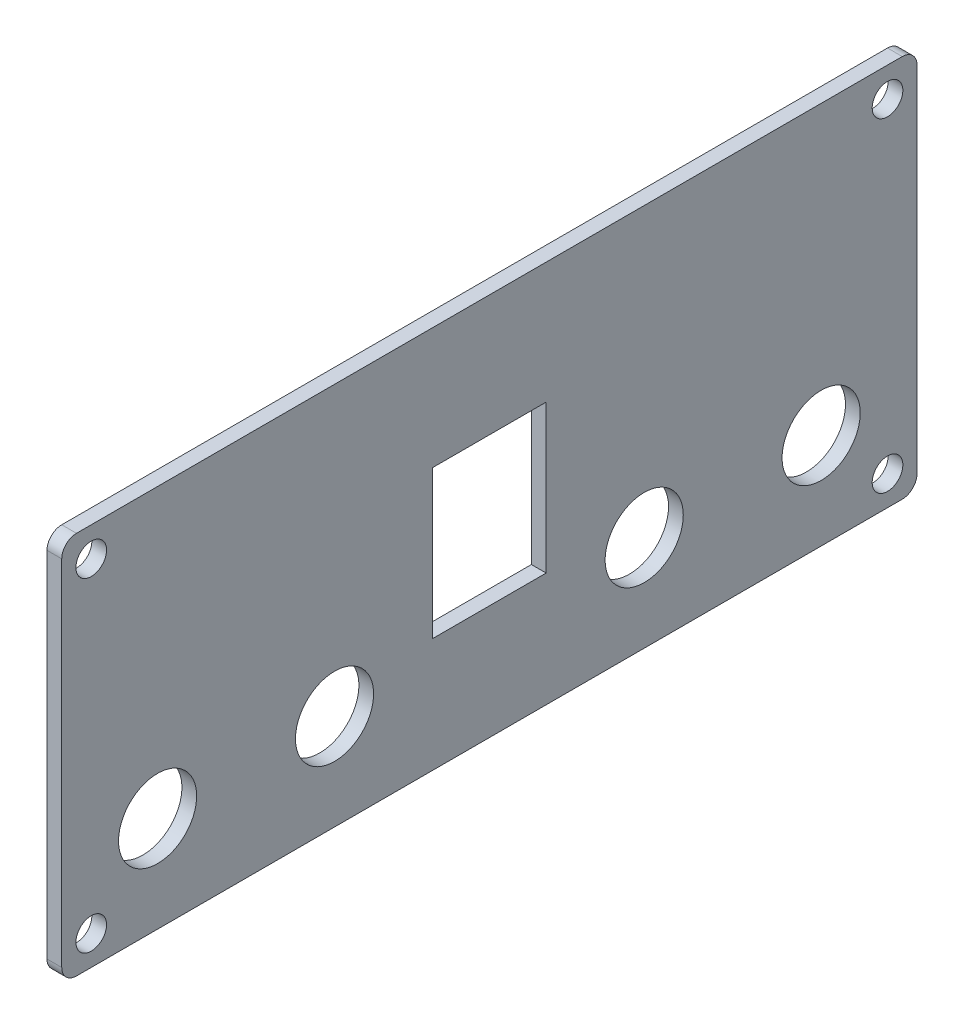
ISO-10303-21;
HEADER;
FILE_DESCRIPTION(('STEP AP214'),'2;1');
FILE_NAME('part.step','',(''),(''),'','','');
FILE_SCHEMA(('AUTOMOTIVE_DESIGN { 1 0 10303 214 1 1 1 1 }'));
ENDSEC;
DATA;
#1=APPLICATION_CONTEXT('core data for automotive mechanical design processes');
#2=APPLICATION_PROTOCOL_DEFINITION('international standard','automotive_design',2000,#1);
#3=PRODUCT_CONTEXT('',#1,'mechanical');
#4=PRODUCT('Part','Part','',(#3));
#5=PRODUCT_RELATED_PRODUCT_CATEGORY('part','',(#4));
#6=PRODUCT_DEFINITION_FORMATION('','',#4);
#7=PRODUCT_DEFINITION_CONTEXT('part definition',#1,'design');
#8=PRODUCT_DEFINITION('design','',#6,#7);
#9=PRODUCT_DEFINITION_SHAPE('','',#8);
#10=(LENGTH_UNIT() NAMED_UNIT(*) SI_UNIT(.MILLI.,.METRE.));
#11=(NAMED_UNIT(*) PLANE_ANGLE_UNIT() SI_UNIT($,.RADIAN.));
#12=(NAMED_UNIT(*) SI_UNIT($,.STERADIAN.) SOLID_ANGLE_UNIT());
#13=UNCERTAINTY_MEASURE_WITH_UNIT(LENGTH_MEASURE(1.E-05),#10,'distance_accuracy_value','');
#14=(GEOMETRIC_REPRESENTATION_CONTEXT(3) GLOBAL_UNCERTAINTY_ASSIGNED_CONTEXT((#13)) GLOBAL_UNIT_ASSIGNED_CONTEXT((#10,
#11,#12)) REPRESENTATION_CONTEXT('',''));
#15=CARTESIAN_POINT('',(0.,0.,0.));
#16=DIRECTION('',(0.,0.,1.));
#17=DIRECTION('',(1.,0.,0.));
#18=AXIS2_PLACEMENT_3D('',#15,#16,#17);
#19=CARTESIAN_POINT('',(-33.450675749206,0.,0.));
#20=DIRECTION('',(1.,0.,0.));
#21=DIRECTION('',(0.,0.,-1.));
#22=AXIS2_PLACEMENT_3D('',#19,#20,#21);
#23=PLANE('',#22);
#24=CARTESIAN_POINT('',(-33.450675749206,-65.961219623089,-62.954833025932));
#25=DIRECTION('',(1.,0.,0.));
#26=DIRECTION('',(0.,0.,-1.));
#27=AXIS2_PLACEMENT_3D('',#24,#25,#26);
#28=CIRCLE('',#27,3.36549999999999);
#29=CARTESIAN_POINT('',(-33.450675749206,-65.961219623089,-66.320333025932));
#30=VERTEX_POINT('',#29);
#31=EDGE_CURVE('E191',#30,#30,#28,.T.);
#32=ORIENTED_EDGE('',*,*,#31,.T.);
#33=EDGE_LOOP('',(#32));
#34=FACE_BOUND('',#33,.T.);
#35=CARTESIAN_POINT('',(-33.450675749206,-65.961219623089,-47.714833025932));
#36=DIRECTION('',(1.,0.,0.));
#37=DIRECTION('',(0.,0.,-1.));
#38=AXIS2_PLACEMENT_3D('',#35,#36,#37);
#39=CIRCLE('',#38,3.3655);
#40=CARTESIAN_POINT('',(-33.450675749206,-65.961219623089,-51.080333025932));
#41=VERTEX_POINT('',#40);
#42=EDGE_CURVE('E563',#41,#41,#39,.T.);
#43=ORIENTED_EDGE('',*,*,#42,.T.);
#44=EDGE_LOOP('',(#43));
#45=FACE_BOUND('',#44,.T.);
#46=DIRECTION('',(0.,0.,-1.));
#47=VECTOR('',#46,1.);
#48=CARTESIAN_POINT('',(-33.450675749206,-64.386419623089,-29.4903330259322));
#49=LINE('',#48,#47);
#50=CARTESIAN_POINT('',(-33.450675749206,-64.386419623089,-29.4903330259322));
#51=VERTEX_POINT('',#50);
#52=CARTESIAN_POINT('',(-33.450675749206,-64.386419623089,-39.2693330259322));
#53=VERTEX_POINT('',#52);
#54=EDGE_CURVE('E140',#51,#53,#49,.T.);
#55=ORIENTED_EDGE('',*,*,#54,.T.);
#56=DIRECTION('',(0.,1.,0.));
#57=VECTOR('',#56,1.);
#58=CARTESIAN_POINT('',(-33.450675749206,-51.635619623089,-39.2693330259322));
#59=LINE('',#58,#57);
#60=CARTESIAN_POINT('',(-33.450675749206,-51.635619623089,-39.2693330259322));
#61=VERTEX_POINT('',#60);
#62=EDGE_CURVE('E133',#53,#61,#59,.T.);
#63=ORIENTED_EDGE('',*,*,#62,.T.);
#64=DIRECTION('',(0.,0.,1.));
#65=VECTOR('',#64,1.);
#66=CARTESIAN_POINT('',(-33.450675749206,-51.635619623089,-29.4903330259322));
#67=LINE('',#66,#65);
#68=CARTESIAN_POINT('',(-33.450675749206,-51.635619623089,-29.4903330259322));
#69=VERTEX_POINT('',#68);
#70=EDGE_CURVE('E143',#61,#69,#67,.T.);
#71=ORIENTED_EDGE('',*,*,#70,.T.);
#72=DIRECTION('',(0.,-1.,0.));
#73=VECTOR('',#72,1.);
#74=CARTESIAN_POINT('',(-33.450675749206,-51.635619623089,-29.4903330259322));
#75=LINE('',#74,#73);
#76=EDGE_CURVE('E57',#69,#51,#75,.T.);
#77=ORIENTED_EDGE('',*,*,#76,.T.);
#78=EDGE_LOOP('',(#55,#63,#71,#77));
#79=FACE_BOUND('',#78,.T.);
#80=CARTESIAN_POINT('',(-33.450675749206,-71.676219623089,-0.0898330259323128));
#81=DIRECTION('',(1.,0.,0.));
#82=DIRECTION('',(0.,0.,1.));
#83=AXIS2_PLACEMENT_3D('',#80,#81,#82);
#84=CIRCLE('',#83,1.32079999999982);
#85=CARTESIAN_POINT('',(-33.450675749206,-71.676219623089,1.2309669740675));
#86=VERTEX_POINT('',#85);
#87=EDGE_CURVE('E182',#86,#86,#84,.T.);
#88=ORIENTED_EDGE('',*,*,#87,.T.);
#89=EDGE_LOOP('',(#88));
#90=FACE_BOUND('',#89,.T.);
#91=CARTESIAN_POINT('',(-33.450675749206,-43.736219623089,-0.0898330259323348));
#92=DIRECTION('',(1.,0.,0.));
#93=DIRECTION('',(0.,0.,1.));
#94=AXIS2_PLACEMENT_3D('',#91,#92,#93);
#95=CIRCLE('',#94,1.3207999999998);
#96=CARTESIAN_POINT('',(-33.450675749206,-43.736219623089,1.23096697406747));
#97=VERTEX_POINT('',#96);
#98=EDGE_CURVE('E192',#97,#97,#95,.T.);
#99=ORIENTED_EDGE('',*,*,#98,.T.);
#100=EDGE_LOOP('',(#99));
#101=FACE_BOUND('',#100,.T.);
#102=CARTESIAN_POINT('',(-33.450675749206,-43.736219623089,-68.669833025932));
#103=DIRECTION('',(1.,0.,0.));
#104=DIRECTION('',(0.,0.,1.));
#105=AXIS2_PLACEMENT_3D('',#102,#103,#104);
#106=CIRCLE('',#105,1.32079999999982);
#107=CARTESIAN_POINT('',(-33.450675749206,-43.736219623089,-67.3490330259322));
#108=VERTEX_POINT('',#107);
#109=EDGE_CURVE('E200',#108,#108,#106,.T.);
#110=ORIENTED_EDGE('',*,*,#109,.T.);
#111=EDGE_LOOP('',(#110));
#112=FACE_BOUND('',#111,.T.);
#113=CARTESIAN_POINT('',(-33.450675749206,-71.676219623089,-68.669833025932));
#114=DIRECTION('',(1.,0.,0.));
#115=DIRECTION('',(0.,0.,1.));
#116=AXIS2_PLACEMENT_3D('',#113,#114,#115);
#117=CIRCLE('',#116,1.32079999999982);
#118=CARTESIAN_POINT('',(-33.450675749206,-71.676219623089,-67.3490330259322));
#119=VERTEX_POINT('',#118);
#120=EDGE_CURVE('E208',#119,#119,#117,.T.);
#121=ORIENTED_EDGE('',*,*,#120,.T.);
#122=EDGE_LOOP('',(#121));
#123=FACE_BOUND('',#122,.T.);
#124=DIRECTION('',(0.,0.,-1.));
#125=VECTOR('',#124,1.);
#126=CARTESIAN_POINT('',(-33.450675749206,-74.216219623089,2.45016697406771));
#127=LINE('',#126,#125);
#128=CARTESIAN_POINT('',(-33.450675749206,-74.216219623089,1.18016697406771));
#129=VERTEX_POINT('',#128);
#130=CARTESIAN_POINT('',(-33.450675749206,-74.216219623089,-69.939833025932));
#131=VERTEX_POINT('',#130);
#132=EDGE_CURVE('E229',#129,#131,#127,.T.);
#133=ORIENTED_EDGE('',*,*,#132,.F.);
#134=CARTESIAN_POINT('',(-33.450675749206,-72.946219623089,1.18016697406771));
#135=DIRECTION('',(1.,0.,0.));
#136=DIRECTION('',(0.,0.,-1.));
#137=AXIS2_PLACEMENT_3D('',#134,#135,#136);
#138=CIRCLE('',#137,1.27);
#139=CARTESIAN_POINT('',(-33.450675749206,-72.946219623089,2.45016697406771));
#140=VERTEX_POINT('',#139);
#141=EDGE_CURVE('E282',#129,#140,#138,.F.);
#142=ORIENTED_EDGE('',*,*,#141,.T.);
#143=DIRECTION('',(0.,-1.,0.));
#144=VECTOR('',#143,1.);
#145=CARTESIAN_POINT('',(-33.450675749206,-41.196219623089,2.45016697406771));
#146=LINE('',#145,#144);
#147=CARTESIAN_POINT('',(-33.450675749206,-42.466219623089,2.45016697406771));
#148=VERTEX_POINT('',#147);
#149=EDGE_CURVE('E225',#148,#140,#146,.T.);
#150=ORIENTED_EDGE('',*,*,#149,.F.);
#151=CARTESIAN_POINT('',(-33.450675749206,-42.466219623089,1.18016697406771));
#152=DIRECTION('',(1.,0.,0.));
#153=DIRECTION('',(0.,0.,-1.));
#154=AXIS2_PLACEMENT_3D('',#151,#152,#153);
#155=CIRCLE('',#154,1.27);
#156=CARTESIAN_POINT('',(-33.450675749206,-41.196219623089,1.18016697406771));
#157=VERTEX_POINT('',#156);
#158=EDGE_CURVE('E276',#148,#157,#155,.F.);
#159=ORIENTED_EDGE('',*,*,#158,.T.);
#160=DIRECTION('',(0.,0.,1.));
#161=VECTOR('',#160,1.);
#162=CARTESIAN_POINT('',(-33.450675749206,-41.196219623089,-71.209833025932));
#163=LINE('',#162,#161);
#164=CARTESIAN_POINT('',(-33.450675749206,-41.196219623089,-69.939833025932));
#165=VERTEX_POINT('',#164);
#166=EDGE_CURVE('E220',#165,#157,#163,.T.);
#167=ORIENTED_EDGE('',*,*,#166,.F.);
#168=CARTESIAN_POINT('',(-33.450675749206,-42.466219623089,-69.939833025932));
#169=DIRECTION('',(1.,0.,0.));
#170=DIRECTION('',(0.,0.,-1.));
#171=AXIS2_PLACEMENT_3D('',#168,#169,#170);
#172=CIRCLE('',#171,1.27);
#173=CARTESIAN_POINT('',(-33.450675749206,-42.466219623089,-71.209833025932));
#174=VERTEX_POINT('',#173);
#175=EDGE_CURVE('E273',#165,#174,#172,.F.);
#176=ORIENTED_EDGE('',*,*,#175,.T.);
#177=DIRECTION('',(0.,1.,0.));
#178=VECTOR('',#177,1.);
#179=CARTESIAN_POINT('',(-33.450675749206,-74.216219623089,-71.209833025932));
#180=LINE('',#179,#178);
#181=CARTESIAN_POINT('',(-33.450675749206,-72.946219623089,-71.209833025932));
#182=VERTEX_POINT('',#181);
#183=EDGE_CURVE('E216',#182,#174,#180,.T.);
#184=ORIENTED_EDGE('',*,*,#183,.F.);
#185=CARTESIAN_POINT('',(-33.450675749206,-72.946219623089,-69.939833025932));
#186=DIRECTION('',(1.,0.,0.));
#187=DIRECTION('',(0.,0.,-1.));
#188=AXIS2_PLACEMENT_3D('',#185,#186,#187);
#189=CIRCLE('',#188,1.27);
#190=EDGE_CURVE('E279',#182,#131,#189,.F.);
#191=ORIENTED_EDGE('',*,*,#190,.T.);
#192=EDGE_LOOP('',(#133,#142,#150,#159,#167,#176,#184,#191));
#193=FACE_BOUND('',#192,.T.);
#194=CARTESIAN_POINT('',(-33.450675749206,-65.961219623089,-21.0448330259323));
#195=DIRECTION('',(-1.,0.,0.));
#196=DIRECTION('',(0.,0.,1.));
#197=AXIS2_PLACEMENT_3D('',#194,#195,#196);
#198=CIRCLE('',#197,3.3655);
#199=CARTESIAN_POINT('',(-33.450675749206,-65.961219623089,-17.6793330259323));
#200=VERTEX_POINT('',#199);
#201=EDGE_CURVE('E546',#200,#200,#198,.T.);
#202=ORIENTED_EDGE('',*,*,#201,.F.);
#203=EDGE_LOOP('',(#202));
#204=FACE_BOUND('',#203,.T.);
#205=CARTESIAN_POINT('',(-33.450675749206,-65.961219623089,-5.80483302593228));
#206=DIRECTION('',(-1.,0.,0.));
#207=DIRECTION('',(0.,0.,1.));
#208=AXIS2_PLACEMENT_3D('',#205,#206,#207);
#209=CIRCLE('',#208,3.36549999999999);
#210=CARTESIAN_POINT('',(-33.450675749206,-65.961219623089,-2.43933302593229));
#211=VERTEX_POINT('',#210);
#212=EDGE_CURVE('E168',#211,#211,#209,.T.);
#213=ORIENTED_EDGE('',*,*,#212,.F.);
#214=EDGE_LOOP('',(#213));
#215=FACE_BOUND('',#214,.T.);
#216=ADVANCED_FACE('F41',(#34,#45,#79,#90,#101,#112,#123,#193,#204,#215),#23,.F.);
#217=CARTESIAN_POINT('',(-32.180675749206,0.,0.));
#218=DIRECTION('',(1.,0.,0.));
#219=DIRECTION('',(0.,0.,-1.));
#220=AXIS2_PLACEMENT_3D('',#217,#218,#219);
#221=PLANE('',#220);
#222=CARTESIAN_POINT('',(-32.180675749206,-65.961219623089,-21.0448330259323));
#223=DIRECTION('',(-1.,0.,0.));
#224=DIRECTION('',(0.,0.,1.));
#225=AXIS2_PLACEMENT_3D('',#222,#223,#224);
#226=CIRCLE('',#225,3.3655);
#227=CARTESIAN_POINT('',(-32.180675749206,-65.961219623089,-17.6793330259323));
#228=VERTEX_POINT('',#227);
#229=EDGE_CURVE('E552',#228,#228,#226,.T.);
#230=ORIENTED_EDGE('',*,*,#229,.T.);
#231=EDGE_LOOP('',(#230));
#232=FACE_BOUND('',#231,.T.);
#233=CARTESIAN_POINT('',(-32.180675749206,-65.961219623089,-62.954833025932));
#234=DIRECTION('',(1.,0.,0.));
#235=DIRECTION('',(0.,0.,-1.));
#236=AXIS2_PLACEMENT_3D('',#233,#234,#235);
#237=CIRCLE('',#236,3.36549999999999);
#238=CARTESIAN_POINT('',(-32.180675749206,-65.961219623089,-66.320333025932));
#239=VERTEX_POINT('',#238);
#240=EDGE_CURVE('E560',#239,#239,#237,.T.);
#241=ORIENTED_EDGE('',*,*,#240,.F.);
#242=EDGE_LOOP('',(#241));
#243=FACE_BOUND('',#242,.T.);
#244=CARTESIAN_POINT('',(-32.180675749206,-65.961219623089,-47.714833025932));
#245=DIRECTION('',(1.,0.,0.));
#246=DIRECTION('',(0.,0.,-1.));
#247=AXIS2_PLACEMENT_3D('',#244,#245,#246);
#248=CIRCLE('',#247,3.3655);
#249=CARTESIAN_POINT('',(-32.180675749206,-65.961219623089,-51.080333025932));
#250=VERTEX_POINT('',#249);
#251=EDGE_CURVE('E158',#250,#250,#248,.T.);
#252=ORIENTED_EDGE('',*,*,#251,.F.);
#253=EDGE_LOOP('',(#252));
#254=FACE_BOUND('',#253,.T.);
#255=DIRECTION('',(0.,1.,0.));
#256=VECTOR('',#255,1.);
#257=CARTESIAN_POINT('',(-32.180675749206,-51.635619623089,-39.2693330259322));
#258=LINE('',#257,#256);
#259=CARTESIAN_POINT('',(-32.180675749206,-64.386419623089,-39.2693330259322));
#260=VERTEX_POINT('',#259);
#261=CARTESIAN_POINT('',(-32.180675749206,-51.635619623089,-39.2693330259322));
#262=VERTEX_POINT('',#261);
#263=EDGE_CURVE('E65',#260,#262,#258,.T.);
#264=ORIENTED_EDGE('',*,*,#263,.F.);
#265=DIRECTION('',(0.,0.,-1.));
#266=VECTOR('',#265,1.);
#267=CARTESIAN_POINT('',(-32.180675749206,-64.386419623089,-29.4903330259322));
#268=LINE('',#267,#266);
#269=CARTESIAN_POINT('',(-32.180675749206,-64.386419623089,-29.4903330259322));
#270=VERTEX_POINT('',#269);
#271=EDGE_CURVE('E151',#270,#260,#268,.T.);
#272=ORIENTED_EDGE('',*,*,#271,.F.);
#273=DIRECTION('',(0.,-1.,0.));
#274=VECTOR('',#273,1.);
#275=CARTESIAN_POINT('',(-32.180675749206,-51.635619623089,-29.4903330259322));
#276=LINE('',#275,#274);
#277=CARTESIAN_POINT('',(-32.180675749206,-51.635619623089,-29.4903330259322));
#278=VERTEX_POINT('',#277);
#279=EDGE_CURVE('E155',#278,#270,#276,.T.);
#280=ORIENTED_EDGE('',*,*,#279,.F.);
#281=DIRECTION('',(0.,0.,1.));
#282=VECTOR('',#281,1.);
#283=CARTESIAN_POINT('',(-32.180675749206,-51.635619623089,-29.4903330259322));
#284=LINE('',#283,#282);
#285=EDGE_CURVE('E167',#262,#278,#284,.T.);
#286=ORIENTED_EDGE('',*,*,#285,.F.);
#287=EDGE_LOOP('',(#264,#272,#280,#286));
#288=FACE_BOUND('',#287,.T.);
#289=CARTESIAN_POINT('',(-32.180675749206,-71.676219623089,-0.0898330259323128));
#290=DIRECTION('',(1.,0.,0.));
#291=DIRECTION('',(0.,0.,1.));
#292=AXIS2_PLACEMENT_3D('',#289,#290,#291);
#293=CIRCLE('',#292,1.32079999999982);
#294=CARTESIAN_POINT('',(-32.180675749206,-71.676219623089,1.2309669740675));
#295=VERTEX_POINT('',#294);
#296=EDGE_CURVE('E187',#295,#295,#293,.T.);
#297=ORIENTED_EDGE('',*,*,#296,.F.);
#298=EDGE_LOOP('',(#297));
#299=FACE_BOUND('',#298,.T.);
#300=CARTESIAN_POINT('',(-32.180675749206,-43.736219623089,-0.0898330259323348));
#301=DIRECTION('',(1.,0.,0.));
#302=DIRECTION('',(0.,0.,1.));
#303=AXIS2_PLACEMENT_3D('',#300,#301,#302);
#304=CIRCLE('',#303,1.3207999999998);
#305=CARTESIAN_POINT('',(-32.180675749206,-43.736219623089,1.23096697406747));
#306=VERTEX_POINT('',#305);
#307=EDGE_CURVE('E186',#306,#306,#304,.T.);
#308=ORIENTED_EDGE('',*,*,#307,.F.);
#309=EDGE_LOOP('',(#308));
#310=FACE_BOUND('',#309,.T.);
#311=CARTESIAN_POINT('',(-32.180675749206,-43.736219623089,-68.669833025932));
#312=DIRECTION('',(1.,0.,0.));
#313=DIRECTION('',(0.,0.,1.));
#314=AXIS2_PLACEMENT_3D('',#311,#312,#313);
#315=CIRCLE('',#314,1.32079999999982);
#316=CARTESIAN_POINT('',(-32.180675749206,-43.736219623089,-67.3490330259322));
#317=VERTEX_POINT('',#316);
#318=EDGE_CURVE('E196',#317,#317,#315,.T.);
#319=ORIENTED_EDGE('',*,*,#318,.F.);
#320=EDGE_LOOP('',(#319));
#321=FACE_BOUND('',#320,.T.);
#322=CARTESIAN_POINT('',(-32.180675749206,-71.676219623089,-68.669833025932));
#323=DIRECTION('',(1.,0.,0.));
#324=DIRECTION('',(0.,0.,1.));
#325=AXIS2_PLACEMENT_3D('',#322,#323,#324);
#326=CIRCLE('',#325,1.32079999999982);
#327=CARTESIAN_POINT('',(-32.180675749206,-71.676219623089,-67.3490330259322));
#328=VERTEX_POINT('',#327);
#329=EDGE_CURVE('E204',#328,#328,#326,.T.);
#330=ORIENTED_EDGE('',*,*,#329,.F.);
#331=EDGE_LOOP('',(#330));
#332=FACE_BOUND('',#331,.T.);
#333=DIRECTION('',(0.,-1.,0.));
#334=VECTOR('',#333,1.);
#335=CARTESIAN_POINT('',(-32.180675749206,-41.196219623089,2.45016697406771));
#336=LINE('',#335,#334);
#337=CARTESIAN_POINT('',(-32.180675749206,-42.466219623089,2.45016697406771));
#338=VERTEX_POINT('',#337);
#339=CARTESIAN_POINT('',(-32.180675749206,-72.946219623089,2.45016697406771));
#340=VERTEX_POINT('',#339);
#341=EDGE_CURVE('E241',#338,#340,#336,.T.);
#342=ORIENTED_EDGE('',*,*,#341,.T.);
#343=CARTESIAN_POINT('',(-32.180675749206,-72.946219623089,1.18016697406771));
#344=DIRECTION('',(1.,0.,0.));
#345=DIRECTION('',(0.,0.,-1.));
#346=AXIS2_PLACEMENT_3D('',#343,#344,#345);
#347=CIRCLE('',#346,1.27);
#348=CARTESIAN_POINT('',(-32.180675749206,-74.216219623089,1.18016697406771));
#349=VERTEX_POINT('',#348);
#350=EDGE_CURVE('E263',#340,#349,#347,.T.);
#351=ORIENTED_EDGE('',*,*,#350,.T.);
#352=DIRECTION('',(0.,0.,-1.));
#353=VECTOR('',#352,1.);
#354=CARTESIAN_POINT('',(-32.180675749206,-74.216219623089,2.45016697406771));
#355=LINE('',#354,#353);
#356=CARTESIAN_POINT('',(-32.180675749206,-74.216219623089,-69.939833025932));
#357=VERTEX_POINT('',#356);
#358=EDGE_CURVE('E221',#349,#357,#355,.T.);
#359=ORIENTED_EDGE('',*,*,#358,.T.);
#360=CARTESIAN_POINT('',(-32.180675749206,-72.946219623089,-69.939833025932));
#361=DIRECTION('',(1.,0.,0.));
#362=DIRECTION('',(0.,0.,-1.));
#363=AXIS2_PLACEMENT_3D('',#360,#361,#362);
#364=CIRCLE('',#363,1.27);
#365=CARTESIAN_POINT('',(-32.180675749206,-72.946219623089,-71.209833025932));
#366=VERTEX_POINT('',#365);
#367=EDGE_CURVE('E260',#357,#366,#364,.T.);
#368=ORIENTED_EDGE('',*,*,#367,.T.);
#369=DIRECTION('',(0.,1.,0.));
#370=VECTOR('',#369,1.);
#371=CARTESIAN_POINT('',(-32.180675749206,-74.216219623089,-71.209833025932));
#372=LINE('',#371,#370);
#373=CARTESIAN_POINT('',(-32.180675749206,-42.466219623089,-71.209833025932));
#374=VERTEX_POINT('',#373);
#375=EDGE_CURVE('E212',#366,#374,#372,.T.);
#376=ORIENTED_EDGE('',*,*,#375,.T.);
#377=CARTESIAN_POINT('',(-32.180675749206,-42.466219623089,-69.939833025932));
#378=DIRECTION('',(1.,0.,0.));
#379=DIRECTION('',(0.,0.,-1.));
#380=AXIS2_PLACEMENT_3D('',#377,#378,#379);
#381=CIRCLE('',#380,1.27);
#382=CARTESIAN_POINT('',(-32.180675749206,-41.196219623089,-69.939833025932));
#383=VERTEX_POINT('',#382);
#384=EDGE_CURVE('E254',#374,#383,#381,.T.);
#385=ORIENTED_EDGE('',*,*,#384,.T.);
#386=DIRECTION('',(0.,0.,1.));
#387=VECTOR('',#386,1.);
#388=CARTESIAN_POINT('',(-32.180675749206,-41.196219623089,-71.209833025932));
#389=LINE('',#388,#387);
#390=CARTESIAN_POINT('',(-32.180675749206,-41.196219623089,1.18016697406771));
#391=VERTEX_POINT('',#390);
#392=EDGE_CURVE('E237',#383,#391,#389,.T.);
#393=ORIENTED_EDGE('',*,*,#392,.T.);
#394=CARTESIAN_POINT('',(-32.180675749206,-42.466219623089,1.18016697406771));
#395=DIRECTION('',(1.,0.,0.));
#396=DIRECTION('',(0.,0.,-1.));
#397=AXIS2_PLACEMENT_3D('',#394,#395,#396);
#398=CIRCLE('',#397,1.27);
#399=EDGE_CURVE('E257',#391,#338,#398,.T.);
#400=ORIENTED_EDGE('',*,*,#399,.T.);
#401=EDGE_LOOP('',(#342,#351,#359,#368,#376,#385,#393,#400));
#402=FACE_BOUND('',#401,.T.);
#403=CARTESIAN_POINT('',(-32.180675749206,-65.961219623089,-5.80483302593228));
#404=DIRECTION('',(-1.,0.,0.));
#405=DIRECTION('',(0.,0.,1.));
#406=AXIS2_PLACEMENT_3D('',#403,#404,#405);
#407=CIRCLE('',#406,3.36549999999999);
#408=CARTESIAN_POINT('',(-32.180675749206,-65.961219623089,-2.43933302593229));
#409=VERTEX_POINT('',#408);
#410=EDGE_CURVE('E544',#409,#409,#407,.T.);
#411=ORIENTED_EDGE('',*,*,#410,.T.);
#412=EDGE_LOOP('',(#411));
#413=FACE_BOUND('',#412,.T.);
#414=ADVANCED_FACE('F312',(#232,#243,#254,#288,#299,#310,#321,#332,#402,#413),#221,.T.);
#415=CARTESIAN_POINT('',(-33.450675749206,-74.216219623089,-71.209833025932));
#416=DIRECTION('',(0.,0.,-1.));
#417=DIRECTION('',(-1.,0.,0.));
#418=AXIS2_PLACEMENT_3D('',#415,#416,#417);
#419=PLANE('',#418);
#420=ORIENTED_EDGE('',*,*,#375,.F.);
#421=DIRECTION('',(1.,0.,0.));
#422=VECTOR('',#421,1.);
#423=CARTESIAN_POINT('',(-33.450675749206,-72.946219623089,-71.209833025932));
#424=LINE('',#423,#422);
#425=EDGE_CURVE('E289',#366,#182,#424,.F.);
#426=ORIENTED_EDGE('',*,*,#425,.T.);
#427=ORIENTED_EDGE('',*,*,#183,.T.);
#428=DIRECTION('',(1.,0.,0.));
#429=VECTOR('',#428,1.);
#430=CARTESIAN_POINT('',(-33.450675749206,-42.466219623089,-71.209833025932));
#431=LINE('',#430,#429);
#432=EDGE_CURVE('E285',#174,#374,#431,.T.);
#433=ORIENTED_EDGE('',*,*,#432,.T.);
#434=EDGE_LOOP('',(#420,#426,#427,#433));
#435=FACE_BOUND('',#434,.T.);
#436=ADVANCED_FACE('F309',(#435),#419,.T.);
#437=CARTESIAN_POINT('',(-33.450675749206,-74.216219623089,2.45016697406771));
#438=DIRECTION('',(0.,-1.,0.));
#439=DIRECTION('',(0.,0.,-1.));
#440=AXIS2_PLACEMENT_3D('',#437,#438,#439);
#441=PLANE('',#440);
#442=ORIENTED_EDGE('',*,*,#358,.F.);
#443=DIRECTION('',(1.,0.,0.));
#444=VECTOR('',#443,1.);
#445=CARTESIAN_POINT('',(-33.450675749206,-74.216219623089,1.18016697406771));
#446=LINE('',#445,#444);
#447=EDGE_CURVE('E270',#349,#129,#446,.F.);
#448=ORIENTED_EDGE('',*,*,#447,.T.);
#449=ORIENTED_EDGE('',*,*,#132,.T.);
#450=DIRECTION('',(1.,0.,0.));
#451=VECTOR('',#450,1.);
#452=CARTESIAN_POINT('',(-33.450675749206,-74.216219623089,-69.939833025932));
#453=LINE('',#452,#451);
#454=EDGE_CURVE('E266',#131,#357,#453,.T.);
#455=ORIENTED_EDGE('',*,*,#454,.T.);
#456=EDGE_LOOP('',(#442,#448,#449,#455));
#457=FACE_BOUND('',#456,.T.);
#458=ADVANCED_FACE('F320',(#457),#441,.T.);
#459=CARTESIAN_POINT('',(-33.450675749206,-41.196219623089,2.45016697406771));
#460=DIRECTION('',(0.,0.,1.));
#461=DIRECTION('',(1.,0.,0.));
#462=AXIS2_PLACEMENT_3D('',#459,#460,#461);
#463=PLANE('',#462);
#464=ORIENTED_EDGE('',*,*,#149,.T.);
#465=DIRECTION('',(1.,0.,0.));
#466=VECTOR('',#465,1.);
#467=CARTESIAN_POINT('',(-33.450675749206,-72.946219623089,2.45016697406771));
#468=LINE('',#467,#466);
#469=EDGE_CURVE('E250',#140,#340,#468,.T.);
#470=ORIENTED_EDGE('',*,*,#469,.T.);
#471=ORIENTED_EDGE('',*,*,#341,.F.);
#472=DIRECTION('',(1.,0.,0.));
#473=VECTOR('',#472,1.);
#474=CARTESIAN_POINT('',(-33.450675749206,-42.466219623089,2.45016697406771));
#475=LINE('',#474,#473);
#476=EDGE_CURVE('E233',#338,#148,#475,.F.);
#477=ORIENTED_EDGE('',*,*,#476,.T.);
#478=EDGE_LOOP('',(#464,#470,#471,#477));
#479=FACE_BOUND('',#478,.T.);
#480=ADVANCED_FACE('F328',(#479),#463,.T.);
#481=CARTESIAN_POINT('',(-33.450675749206,-41.196219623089,-71.209833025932));
#482=DIRECTION('',(0.,1.,0.));
#483=DIRECTION('',(0.,0.,1.));
#484=AXIS2_PLACEMENT_3D('',#481,#482,#483);
#485=PLANE('',#484);
#486=ORIENTED_EDGE('',*,*,#166,.T.);
#487=DIRECTION('',(1.,0.,0.));
#488=VECTOR('',#487,1.);
#489=CARTESIAN_POINT('',(-33.450675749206,-41.196219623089,1.18016697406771));
#490=LINE('',#489,#488);
#491=EDGE_CURVE('E11',#157,#391,#490,.T.);
#492=ORIENTED_EDGE('',*,*,#491,.T.);
#493=ORIENTED_EDGE('',*,*,#392,.F.);
#494=DIRECTION('',(1.,0.,0.));
#495=VECTOR('',#494,1.);
#496=CARTESIAN_POINT('',(-33.450675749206,-41.196219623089,-69.939833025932));
#497=LINE('',#496,#495);
#498=EDGE_CURVE('E50',#383,#165,#497,.F.);
#499=ORIENTED_EDGE('',*,*,#498,.T.);
#500=EDGE_LOOP('',(#486,#492,#493,#499));
#501=FACE_BOUND('',#500,.T.);
#502=ADVANCED_FACE('F296',(#501),#485,.T.);
#503=CARTESIAN_POINT('',(-33.450675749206,-71.676219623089,-68.669833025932));
#504=DIRECTION('',(1.,0.,0.));
#505=DIRECTION('',(0.,0.,-1.));
#506=AXIS2_PLACEMENT_3D('',#503,#504,#505);
#507=CYLINDRICAL_SURFACE('',#506,1.32079999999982);
#508=ORIENTED_EDGE('',*,*,#120,.F.);
#509=EDGE_LOOP('',(#508));
#510=FACE_BOUND('',#509,.T.);
#511=ORIENTED_EDGE('',*,*,#329,.T.);
#512=EDGE_LOOP('',(#511));
#513=FACE_BOUND('',#512,.T.);
#514=ADVANCED_FACE('F349',(#510,#513),#507,.F.);
#515=CARTESIAN_POINT('',(-33.450675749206,-43.736219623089,-68.669833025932));
#516=DIRECTION('',(1.,0.,0.));
#517=DIRECTION('',(0.,0.,-1.));
#518=AXIS2_PLACEMENT_3D('',#515,#516,#517);
#519=CYLINDRICAL_SURFACE('',#518,1.32079999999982);
#520=ORIENTED_EDGE('',*,*,#109,.F.);
#521=EDGE_LOOP('',(#520));
#522=FACE_BOUND('',#521,.T.);
#523=ORIENTED_EDGE('',*,*,#318,.T.);
#524=EDGE_LOOP('',(#523));
#525=FACE_BOUND('',#524,.T.);
#526=ADVANCED_FACE('F371',(#522,#525),#519,.F.);
#527=CARTESIAN_POINT('',(-33.450675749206,-43.736219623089,-0.0898330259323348));
#528=DIRECTION('',(1.,0.,0.));
#529=DIRECTION('',(0.,0.,-1.));
#530=AXIS2_PLACEMENT_3D('',#527,#528,#529);
#531=CYLINDRICAL_SURFACE('',#530,1.3207999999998);
#532=ORIENTED_EDGE('',*,*,#98,.F.);
#533=EDGE_LOOP('',(#532));
#534=FACE_BOUND('',#533,.T.);
#535=ORIENTED_EDGE('',*,*,#307,.T.);
#536=EDGE_LOOP('',(#535));
#537=FACE_BOUND('',#536,.T.);
#538=ADVANCED_FACE('F365',(#534,#537),#531,.F.);
#539=CARTESIAN_POINT('',(-33.450675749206,-71.676219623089,-0.0898330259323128));
#540=DIRECTION('',(1.,0.,0.));
#541=DIRECTION('',(0.,0.,-1.));
#542=AXIS2_PLACEMENT_3D('',#539,#540,#541);
#543=CYLINDRICAL_SURFACE('',#542,1.32079999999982);
#544=ORIENTED_EDGE('',*,*,#87,.F.);
#545=EDGE_LOOP('',(#544));
#546=FACE_BOUND('',#545,.T.);
#547=ORIENTED_EDGE('',*,*,#296,.T.);
#548=EDGE_LOOP('',(#547));
#549=FACE_BOUND('',#548,.T.);
#550=ADVANCED_FACE('F361',(#546,#549),#543,.F.);
#551=CARTESIAN_POINT('',(-33.450675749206,-72.946219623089,1.18016697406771));
#552=DIRECTION('',(1.,0.,0.));
#553=DIRECTION('',(0.,0.,-1.));
#554=AXIS2_PLACEMENT_3D('',#551,#552,#553);
#555=CYLINDRICAL_SURFACE('',#554,1.27);
#556=ORIENTED_EDGE('',*,*,#141,.F.);
#557=ORIENTED_EDGE('',*,*,#447,.F.);
#558=ORIENTED_EDGE('',*,*,#350,.F.);
#559=ORIENTED_EDGE('',*,*,#469,.F.);
#560=EDGE_LOOP('',(#556,#557,#558,#559));
#561=FACE_BOUND('',#560,.T.);
#562=ADVANCED_FACE('F325',(#561),#555,.T.);
#563=CARTESIAN_POINT('',(-33.450675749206,-72.946219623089,-69.939833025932));
#564=DIRECTION('',(1.,0.,0.));
#565=DIRECTION('',(0.,0.,-1.));
#566=AXIS2_PLACEMENT_3D('',#563,#564,#565);
#567=CYLINDRICAL_SURFACE('',#566,1.27);
#568=ORIENTED_EDGE('',*,*,#190,.F.);
#569=ORIENTED_EDGE('',*,*,#425,.F.);
#570=ORIENTED_EDGE('',*,*,#367,.F.);
#571=ORIENTED_EDGE('',*,*,#454,.F.);
#572=EDGE_LOOP('',(#568,#569,#570,#571));
#573=FACE_BOUND('',#572,.T.);
#574=ADVANCED_FACE('F318',(#573),#567,.T.);
#575=CARTESIAN_POINT('',(-33.450675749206,-42.466219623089,1.18016697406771));
#576=DIRECTION('',(1.,0.,0.));
#577=DIRECTION('',(0.,0.,-1.));
#578=AXIS2_PLACEMENT_3D('',#575,#576,#577);
#579=CYLINDRICAL_SURFACE('',#578,1.27);
#580=ORIENTED_EDGE('',*,*,#158,.F.);
#581=ORIENTED_EDGE('',*,*,#476,.F.);
#582=ORIENTED_EDGE('',*,*,#399,.F.);
#583=ORIENTED_EDGE('',*,*,#491,.F.);
#584=EDGE_LOOP('',(#580,#581,#582,#583));
#585=FACE_BOUND('',#584,.T.);
#586=ADVANCED_FACE('F331',(#585),#579,.T.);
#587=CARTESIAN_POINT('',(-33.450675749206,-42.466219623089,-69.939833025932));
#588=DIRECTION('',(1.,0.,0.));
#589=DIRECTION('',(0.,0.,-1.));
#590=AXIS2_PLACEMENT_3D('',#587,#588,#589);
#591=CYLINDRICAL_SURFACE('',#590,1.27);
#592=ORIENTED_EDGE('',*,*,#175,.F.);
#593=ORIENTED_EDGE('',*,*,#498,.F.);
#594=ORIENTED_EDGE('',*,*,#384,.F.);
#595=ORIENTED_EDGE('',*,*,#432,.F.);
#596=EDGE_LOOP('',(#592,#593,#594,#595));
#597=FACE_BOUND('',#596,.T.);
#598=ADVANCED_FACE('F43',(#597),#591,.T.);
#599=CARTESIAN_POINT('',(-33.450675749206,-51.635619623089,-39.2693330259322));
#600=DIRECTION('',(0.,0.,-1.));
#601=DIRECTION('',(-1.,0.,0.));
#602=AXIS2_PLACEMENT_3D('',#599,#600,#601);
#603=PLANE('',#602);
#604=ORIENTED_EDGE('',*,*,#263,.T.);
#605=DIRECTION('',(1.,0.,0.));
#606=VECTOR('',#605,1.);
#607=CARTESIAN_POINT('',(-33.450675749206,-51.635619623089,-39.2693330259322));
#608=LINE('',#607,#606);
#609=EDGE_CURVE('E129',#61,#262,#608,.T.);
#610=ORIENTED_EDGE('',*,*,#609,.F.);
#611=ORIENTED_EDGE('',*,*,#62,.F.);
#612=DIRECTION('',(1.,0.,0.));
#613=VECTOR('',#612,1.);
#614=CARTESIAN_POINT('',(-33.450675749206,-64.386419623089,-39.2693330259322));
#615=LINE('',#614,#613);
#616=EDGE_CURVE('E174',#53,#260,#615,.T.);
#617=ORIENTED_EDGE('',*,*,#616,.T.);
#618=EDGE_LOOP('',(#604,#610,#611,#617));
#619=FACE_BOUND('',#618,.T.);
#620=ADVANCED_FACE('F131',(#619),#603,.F.);
#621=CARTESIAN_POINT('',(-33.450675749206,-64.386419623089,-29.4903330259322));
#622=DIRECTION('',(0.,-1.,0.));
#623=DIRECTION('',(0.,0.,-1.));
#624=AXIS2_PLACEMENT_3D('',#621,#622,#623);
#625=PLANE('',#624);
#626=ORIENTED_EDGE('',*,*,#271,.T.);
#627=ORIENTED_EDGE('',*,*,#616,.F.);
#628=ORIENTED_EDGE('',*,*,#54,.F.);
#629=DIRECTION('',(1.,0.,0.));
#630=VECTOR('',#629,1.);
#631=CARTESIAN_POINT('',(-33.450675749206,-64.386419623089,-29.4903330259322));
#632=LINE('',#631,#630);
#633=EDGE_CURVE('E177',#51,#270,#632,.T.);
#634=ORIENTED_EDGE('',*,*,#633,.T.);
#635=EDGE_LOOP('',(#626,#627,#628,#634));
#636=FACE_BOUND('',#635,.T.);
#637=ADVANCED_FACE('F457',(#636),#625,.F.);
#638=CARTESIAN_POINT('',(-33.450675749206,-51.635619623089,-29.4903330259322));
#639=DIRECTION('',(0.,0.,1.));
#640=DIRECTION('',(1.,0.,0.));
#641=AXIS2_PLACEMENT_3D('',#638,#639,#640);
#642=PLANE('',#641);
#643=ORIENTED_EDGE('',*,*,#279,.T.);
#644=ORIENTED_EDGE('',*,*,#633,.F.);
#645=ORIENTED_EDGE('',*,*,#76,.F.);
#646=DIRECTION('',(1.,0.,0.));
#647=VECTOR('',#646,1.);
#648=CARTESIAN_POINT('',(-33.450675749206,-51.635619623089,-29.4903330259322));
#649=LINE('',#648,#647);
#650=EDGE_CURVE('E139',#69,#278,#649,.T.);
#651=ORIENTED_EDGE('',*,*,#650,.T.);
#652=EDGE_LOOP('',(#643,#644,#645,#651));
#653=FACE_BOUND('',#652,.T.);
#654=ADVANCED_FACE('F465',(#653),#642,.F.);
#655=CARTESIAN_POINT('',(-33.450675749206,-51.635619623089,-29.4903330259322));
#656=DIRECTION('',(0.,1.,0.));
#657=DIRECTION('',(0.,0.,1.));
#658=AXIS2_PLACEMENT_3D('',#655,#656,#657);
#659=PLANE('',#658);
#660=ORIENTED_EDGE('',*,*,#285,.T.);
#661=ORIENTED_EDGE('',*,*,#650,.F.);
#662=ORIENTED_EDGE('',*,*,#70,.F.);
#663=ORIENTED_EDGE('',*,*,#609,.T.);
#664=EDGE_LOOP('',(#660,#661,#662,#663));
#665=FACE_BOUND('',#664,.T.);
#666=ADVANCED_FACE('F144',(#665),#659,.F.);
#667=CARTESIAN_POINT('',(-33.450675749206,-65.961219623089,-47.714833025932));
#668=DIRECTION('',(1.,0.,0.));
#669=DIRECTION('',(0.,0.,-1.));
#670=AXIS2_PLACEMENT_3D('',#667,#668,#669);
#671=CYLINDRICAL_SURFACE('',#670,3.3655);
#672=ORIENTED_EDGE('',*,*,#42,.F.);
#673=EDGE_LOOP('',(#672));
#674=FACE_BOUND('',#673,.T.);
#675=ORIENTED_EDGE('',*,*,#251,.T.);
#676=EDGE_LOOP('',(#675));
#677=FACE_BOUND('',#676,.T.);
#678=ADVANCED_FACE('F483',(#674,#677),#671,.F.);
#679=CARTESIAN_POINT('',(-33.450675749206,-65.961219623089,-62.954833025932));
#680=DIRECTION('',(1.,0.,0.));
#681=DIRECTION('',(0.,0.,-1.));
#682=AXIS2_PLACEMENT_3D('',#679,#680,#681);
#683=CYLINDRICAL_SURFACE('',#682,3.36549999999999);
#684=ORIENTED_EDGE('',*,*,#31,.F.);
#685=EDGE_LOOP('',(#684));
#686=FACE_BOUND('',#685,.T.);
#687=ORIENTED_EDGE('',*,*,#240,.T.);
#688=EDGE_LOOP('',(#687));
#689=FACE_BOUND('',#688,.T.);
#690=ADVANCED_FACE('F491',(#686,#689),#683,.F.);
#691=CARTESIAN_POINT('',(-33.450675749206,-65.961219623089,-21.0448330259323));
#692=DIRECTION('',(1.,0.,0.));
#693=DIRECTION('',(0.,0.,-1.));
#694=AXIS2_PLACEMENT_3D('',#691,#692,#693);
#695=CYLINDRICAL_SURFACE('',#694,3.3655);
#696=ORIENTED_EDGE('',*,*,#201,.T.);
#697=EDGE_LOOP('',(#696));
#698=FACE_BOUND('',#697,.T.);
#699=ORIENTED_EDGE('',*,*,#229,.F.);
#700=EDGE_LOOP('',(#699));
#701=FACE_BOUND('',#700,.T.);
#702=ADVANCED_FACE('F500',(#698,#701),#695,.F.);
#703=CARTESIAN_POINT('',(-33.450675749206,-65.961219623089,-5.80483302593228));
#704=DIRECTION('',(1.,0.,0.));
#705=DIRECTION('',(0.,0.,-1.));
#706=AXIS2_PLACEMENT_3D('',#703,#704,#705);
#707=CYLINDRICAL_SURFACE('',#706,3.36549999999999);
#708=ORIENTED_EDGE('',*,*,#212,.T.);
#709=EDGE_LOOP('',(#708));
#710=FACE_BOUND('',#709,.T.);
#711=ORIENTED_EDGE('',*,*,#410,.F.);
#712=EDGE_LOOP('',(#711));
#713=FACE_BOUND('',#712,.T.);
#714=ADVANCED_FACE('F525',(#710,#713),#707,.F.);
#715=CLOSED_SHELL('',(#216,#414,#436,#458,#480,#502,#514,#526,#538,#550,#562,#574,#586,#598,
#620,#637,#654,#666,#678,#690,#702,#714));
#716=MANIFOLD_SOLID_BREP('B2',#715);
#717=ADVANCED_BREP_SHAPE_REPRESENTATION('',(#18,#716),#14);
#718=SHAPE_DEFINITION_REPRESENTATION(#9,#717);
ENDSEC;
END-ISO-10303-21;
